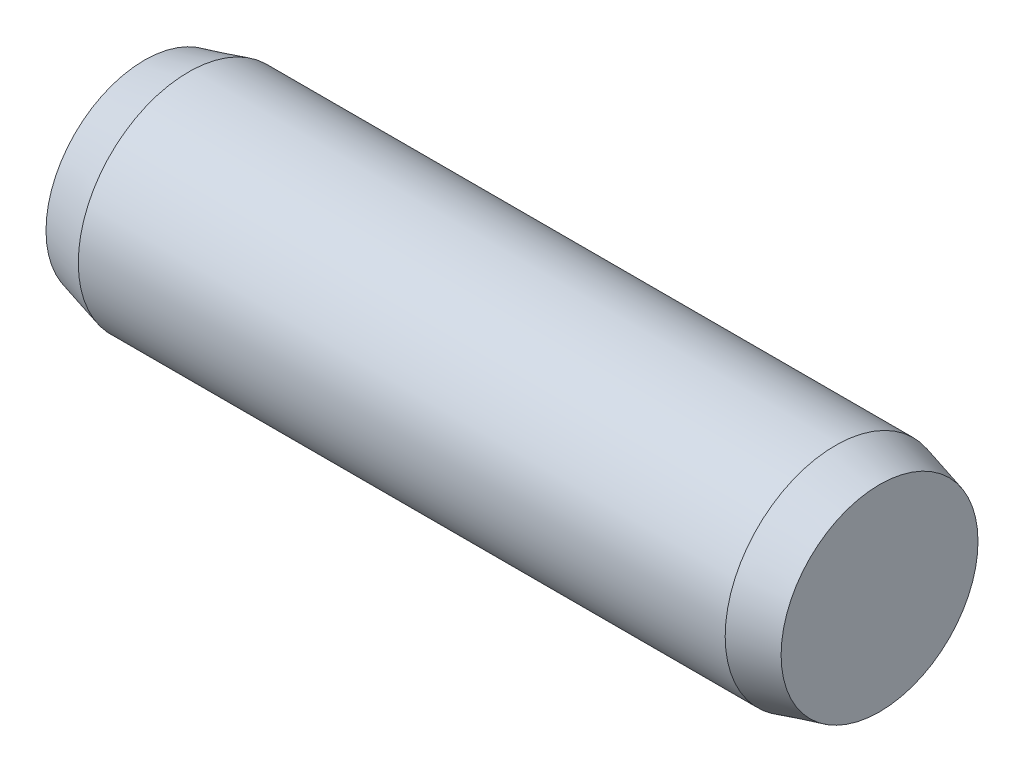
from build123d import *


with BuildPart() as part:
    # Sketch1 → Base-Revolve (revolve)
    with BuildSketch(Plane.XY, mode=Mode.PRIVATE) as base_revolve_sk:
        Polygon((0, 0), (2, 0), (2, 0.267846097), (1.88, 0.3), (0.12, 0.3), (0, 0.267846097), align=None)
    revolve(base_revolve_sk.sketch.rotate(Axis((-1.655717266, 0, 0), (1, 0, 0)), 90), axis=Axis((-1.655717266, 0, 0), (1, 0, 0)))


solid = part.part
